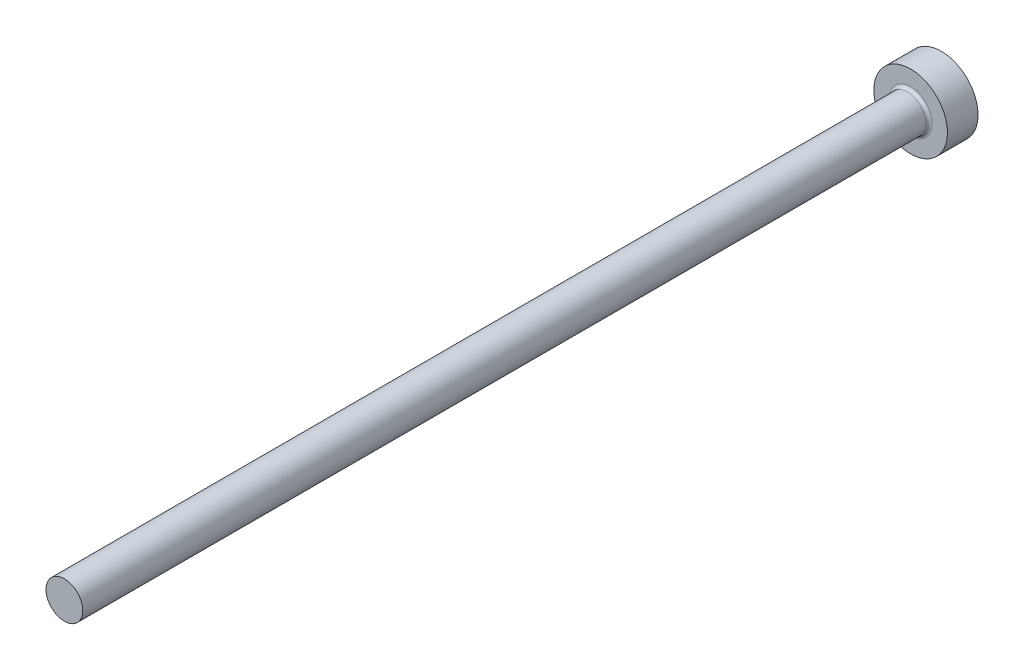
ISO-10303-21;
HEADER;
FILE_DESCRIPTION(('STEP AP214'),'2;1');
FILE_NAME('part.step','',(''),(''),'','','');
FILE_SCHEMA(('AUTOMOTIVE_DESIGN { 1 0 10303 214 1 1 1 1 }'));
ENDSEC;
DATA;
#1=APPLICATION_CONTEXT('core data for automotive mechanical design processes');
#2=APPLICATION_PROTOCOL_DEFINITION('international standard','automotive_design',2000,#1);
#3=PRODUCT_CONTEXT('',#1,'mechanical');
#4=PRODUCT('Part','Part','',(#3));
#5=PRODUCT_RELATED_PRODUCT_CATEGORY('part','',(#4));
#6=PRODUCT_DEFINITION_FORMATION('','',#4);
#7=PRODUCT_DEFINITION_CONTEXT('part definition',#1,'design');
#8=PRODUCT_DEFINITION('design','',#6,#7);
#9=PRODUCT_DEFINITION_SHAPE('','',#8);
#10=(LENGTH_UNIT() NAMED_UNIT(*) SI_UNIT(.MILLI.,.METRE.));
#11=(NAMED_UNIT(*) PLANE_ANGLE_UNIT() SI_UNIT($,.RADIAN.));
#12=(NAMED_UNIT(*) SI_UNIT($,.STERADIAN.) SOLID_ANGLE_UNIT());
#13=UNCERTAINTY_MEASURE_WITH_UNIT(LENGTH_MEASURE(1.E-05),#10,'distance_accuracy_value','');
#14=(GEOMETRIC_REPRESENTATION_CONTEXT(3) GLOBAL_UNCERTAINTY_ASSIGNED_CONTEXT((#13)) GLOBAL_UNIT_ASSIGNED_CONTEXT((#10,
#11,#12)) REPRESENTATION_CONTEXT('',''));
#15=CARTESIAN_POINT('',(0.,0.,0.));
#16=DIRECTION('',(0.,0.,1.));
#17=DIRECTION('',(1.,0.,0.));
#18=AXIS2_PLACEMENT_3D('',#15,#16,#17);
#19=CARTESIAN_POINT('',(8.33773218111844E-06,-60.5162145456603,-129.9996));
#20=DIRECTION('',(0.,0.,1.));
#21=DIRECTION('',(1.,0.,0.));
#22=AXIS2_PLACEMENT_3D('',#19,#20,#21);
#23=CYLINDRICAL_SURFACE('',#22,3.);
#24=CARTESIAN_POINT('',(8.33773218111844E-06,-60.5162145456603,-137.5));
#25=DIRECTION('',(0.,0.,-1.));
#26=DIRECTION('',(-1.,0.,0.));
#27=AXIS2_PLACEMENT_3D('',#24,#25,#26);
#28=CIRCLE('',#27,3.);
#29=CARTESIAN_POINT('',(-2.99999166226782,-60.5162145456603,-137.5));
#30=VERTEX_POINT('',#29);
#31=EDGE_CURVE('E22',#30,#30,#28,.F.);
#32=ORIENTED_EDGE('',*,*,#31,.T.);
#33=EDGE_LOOP('',(#32));
#34=FACE_BOUND('',#33,.T.);
#35=CARTESIAN_POINT('',(8.33773218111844E-06,-60.5162145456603,0.));
#36=DIRECTION('',(0.,0.,1.));
#37=DIRECTION('',(1.,0.,0.));
#38=AXIS2_PLACEMENT_3D('',#35,#36,#37);
#39=CIRCLE('',#38,3.);
#40=CARTESIAN_POINT('',(3.00000833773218,-60.5162145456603,0.));
#41=VERTEX_POINT('',#40);
#42=EDGE_CURVE('E18',#41,#41,#39,.T.);
#43=ORIENTED_EDGE('',*,*,#42,.F.);
#44=EDGE_LOOP('',(#43));
#45=FACE_BOUND('',#44,.T.);
#46=ADVANCED_FACE('F14',(#34,#45),#23,.T.);
#47=CARTESIAN_POINT('',(8.33773218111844E-06,-60.5162145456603,-138.));
#48=DIRECTION('',(0.,0.,-1.));
#49=DIRECTION('',(-1.,0.,0.));
#50=AXIS2_PLACEMENT_3D('',#47,#48,#49);
#51=PLANE('',#50);
#52=CARTESIAN_POINT('',(8.33773218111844E-06,-60.5162145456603,-138.));
#53=DIRECTION('',(0.,0.,-1.));
#54=DIRECTION('',(-1.,0.,0.));
#55=AXIS2_PLACEMENT_3D('',#52,#53,#54);
#56=CIRCLE('',#55,3.5);
#57=CARTESIAN_POINT('',(-3.49999166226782,-60.5162145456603,-138.));
#58=VERTEX_POINT('',#57);
#59=EDGE_CURVE('E10',#58,#58,#56,.T.);
#60=ORIENTED_EDGE('',*,*,#59,.T.);
#61=EDGE_LOOP('',(#60));
#62=FACE_BOUND('',#61,.T.);
#63=CARTESIAN_POINT('',(8.33773218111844E-06,-60.5162145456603,-138.));
#64=DIRECTION('',(0.,0.,-1.));
#65=DIRECTION('',(-1.,0.,0.));
#66=AXIS2_PLACEMENT_3D('',#63,#64,#65);
#67=CIRCLE('',#66,6.);
#68=CARTESIAN_POINT('',(-5.99999166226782,-60.5162145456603,-138.));
#69=VERTEX_POINT('',#68);
#70=EDGE_CURVE('E26',#69,#69,#67,.T.);
#71=ORIENTED_EDGE('',*,*,#70,.F.);
#72=EDGE_LOOP('',(#71));
#73=FACE_BOUND('',#72,.T.);
#74=ADVANCED_FACE('F38',(#62,#73),#51,.F.);
#75=CARTESIAN_POINT('',(8.33773218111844E-06,-60.5162145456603,-138.));
#76=DIRECTION('',(0.,0.,-1.));
#77=DIRECTION('',(-1.,0.,0.));
#78=AXIS2_PLACEMENT_3D('',#75,#76,#77);
#79=CYLINDRICAL_SURFACE('',#78,6.);
#80=ORIENTED_EDGE('',*,*,#70,.T.);
#81=EDGE_LOOP('',(#80));
#82=FACE_BOUND('',#81,.T.);
#83=CARTESIAN_POINT('',(8.33773218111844E-06,-60.5162145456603,-143.));
#84=DIRECTION('',(0.,0.,-1.));
#85=DIRECTION('',(-1.,0.,0.));
#86=AXIS2_PLACEMENT_3D('',#83,#84,#85);
#87=CIRCLE('',#86,6.);
#88=CARTESIAN_POINT('',(-5.99999166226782,-60.5162145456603,-143.));
#89=VERTEX_POINT('',#88);
#90=EDGE_CURVE('E29',#89,#89,#87,.T.);
#91=ORIENTED_EDGE('',*,*,#90,.F.);
#92=EDGE_LOOP('',(#91));
#93=FACE_BOUND('',#92,.T.);
#94=ADVANCED_FACE('F35',(#82,#93),#79,.T.);
#95=CARTESIAN_POINT('',(8.33773218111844E-06,-60.5162145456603,-143.));
#96=DIRECTION('',(0.,0.,-1.));
#97=DIRECTION('',(-1.,0.,0.));
#98=AXIS2_PLACEMENT_3D('',#95,#96,#97);
#99=PLANE('',#98);
#100=ORIENTED_EDGE('',*,*,#90,.T.);
#101=EDGE_LOOP('',(#100));
#102=FACE_BOUND('',#101,.T.);
#103=ADVANCED_FACE('F46',(#102),#99,.T.);
#104=CARTESIAN_POINT('',(8.33773218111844E-06,-60.5162145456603,-137.5));
#105=DIRECTION('',(0.,0.,-1.));
#106=DIRECTION('',(-1.,0.,0.));
#107=AXIS2_PLACEMENT_3D('',#104,#105,#106);
#108=TOROIDAL_SURFACE('',#107,3.5,0.5);
#109=ORIENTED_EDGE('',*,*,#59,.F.);
#110=EDGE_LOOP('',(#109));
#111=FACE_BOUND('',#110,.T.);
#112=ORIENTED_EDGE('',*,*,#31,.F.);
#113=EDGE_LOOP('',(#112));
#114=FACE_BOUND('',#113,.T.);
#115=ADVANCED_FACE('F16',(#111,#114),#108,.F.);
#116=CARTESIAN_POINT('',(-91.8,64.515,0.));
#117=DIRECTION('',(0.,0.,1.));
#118=DIRECTION('',(1.,0.,0.));
#119=AXIS2_PLACEMENT_3D('',#116,#117,#118);
#120=PLANE('',#119);
#121=ORIENTED_EDGE('',*,*,#42,.T.);
#122=EDGE_LOOP('',(#121));
#123=FACE_BOUND('',#122,.T.);
#124=ADVANCED_FACE('F56',(#123),#120,.T.);
#125=CLOSED_SHELL('',(#46,#74,#94,#103,#115,#124));
#126=MANIFOLD_SOLID_BREP('B1',#125);
#127=ADVANCED_BREP_SHAPE_REPRESENTATION('',(#18,#126),#14);
#128=SHAPE_DEFINITION_REPRESENTATION(#9,#127);
ENDSEC;
END-ISO-10303-21;
